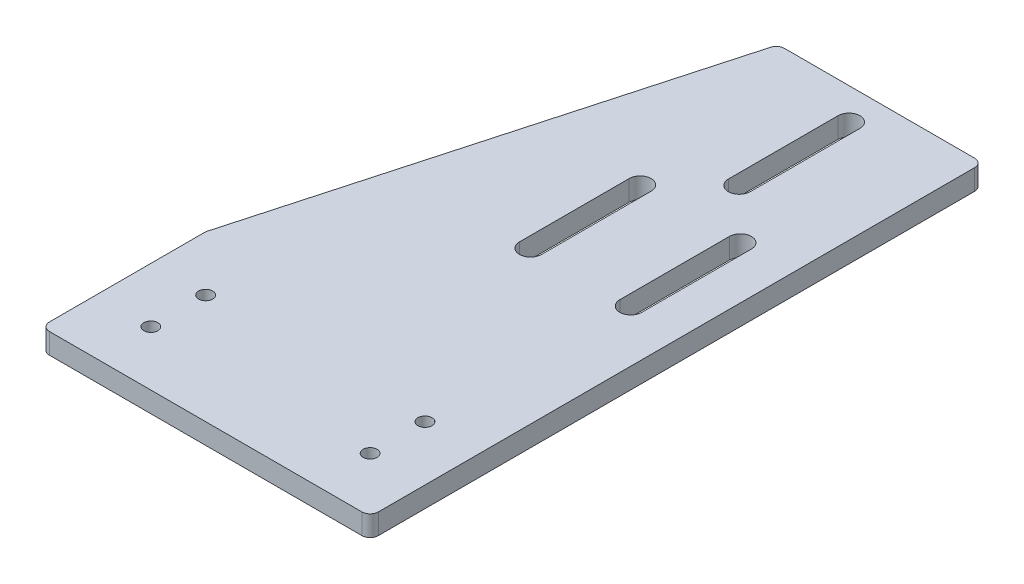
from build123d import *

# Parameters (mm, degrees)
SKETCH4_R           = 3.2512
BOSS_EXTRUDE1_DEPTH = 9.525


with BuildPart() as part:
    # Sketch4 → Boss-Extrude1 (new body)
    with BuildSketch(Plane(origin=(0, 0, 0), x_dir=(1, 0, 0), z_dir=(0, 1, 0))):
        with BuildLine():
            Line((-48.168189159, 52.45363032), (-104.867602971, -151.900126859))
            ThreePointArc((-104.867602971, -151.900126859), (-104.971463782, -152.40474269), (-105.006296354, -152.918757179))
            Line((-105.006296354, -152.918757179), (-105.006296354, -224.79))
            ThreePointArc((-105.006296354, -224.79), (-103.890373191, -227.484076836), (-101.196296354, -228.6))
            Line((-101.196296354, -228.6), (43.583703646, -228.6))
            ThreePointArc((43.583703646, -228.6), (46.277780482, -227.484076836), (47.393703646, -224.79))
            Line((47.393703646, -224.79), (47.393703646, 51.435))
            ThreePointArc((47.393703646, 51.435), (46.277780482, 54.129076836), (43.583703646, 55.245))
            Line((43.583703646, 55.245), (-44.496882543, 55.245))
            ThreePointArc((-44.496882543, 55.245), (-46.802865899, 54.467909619), (-48.168189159, 52.45363032))
        make_face()
        with Locations(Location((21.993703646, -203.2, 0), (0, 0, 90))):
            Circle(SKETCH4_R, mode=Mode.SUBTRACT)
        with Locations(Location((21.993703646, -177.8, 0), (0, 0, 90))):
            Circle(SKETCH4_R, mode=Mode.SUBTRACT)
        with Locations(Location((-79.606296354, -203.2, 0), (0, 0, 90))):
            Circle(SKETCH4_R, mode=Mode.SUBTRACT)
        with Locations(Location((-79.606296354, -177.8, 0), (0, 0, 90))):
            Circle(SKETCH4_R, mode=Mode.SUBTRACT)
        with BuildLine():
            Line((18.183703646, -83.742865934), (18.183703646, -32.942865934))
            ThreePointArc((18.183703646, -32.942865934), (23.263703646, -27.862865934), (28.343703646, -32.942865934))
            Line((28.343703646, -32.942865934), (28.343703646, -83.742865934))
            ThreePointArc((28.343703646, -83.742865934), (23.263703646, -88.822865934), (18.183703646, -83.742865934))
        make_face(mode=Mode.SUBTRACT)
        with BuildLine():
            Line((-5.08, -10.16), (-5.08, 40.64))
            ThreePointArc((-5.08, 40.64), (0, 45.72), (5.08, 40.64))
            Line((5.08, 40.64), (5.08, -10.16))
            ThreePointArc((5.08, -10.16), (0, -15.24), (-5.08, -10.16))
        make_face(mode=Mode.SUBTRACT)
        with BuildLine():
            Line((-28.247895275, -83.742865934), (-28.247895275, -32.942865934))
            ThreePointArc((-28.247895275, -32.942865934), (-23.167895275, -27.862865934), (-18.087895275, -32.942865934))
            Line((-18.087895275, -32.942865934), (-18.087895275, -83.742865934))
            ThreePointArc((-18.087895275, -83.742865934), (-23.167895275, -88.822865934), (-28.247895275, -83.742865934))
        make_face(mode=Mode.SUBTRACT)
    extrude(amount=BOSS_EXTRUDE1_DEPTH)


solid = part.part
